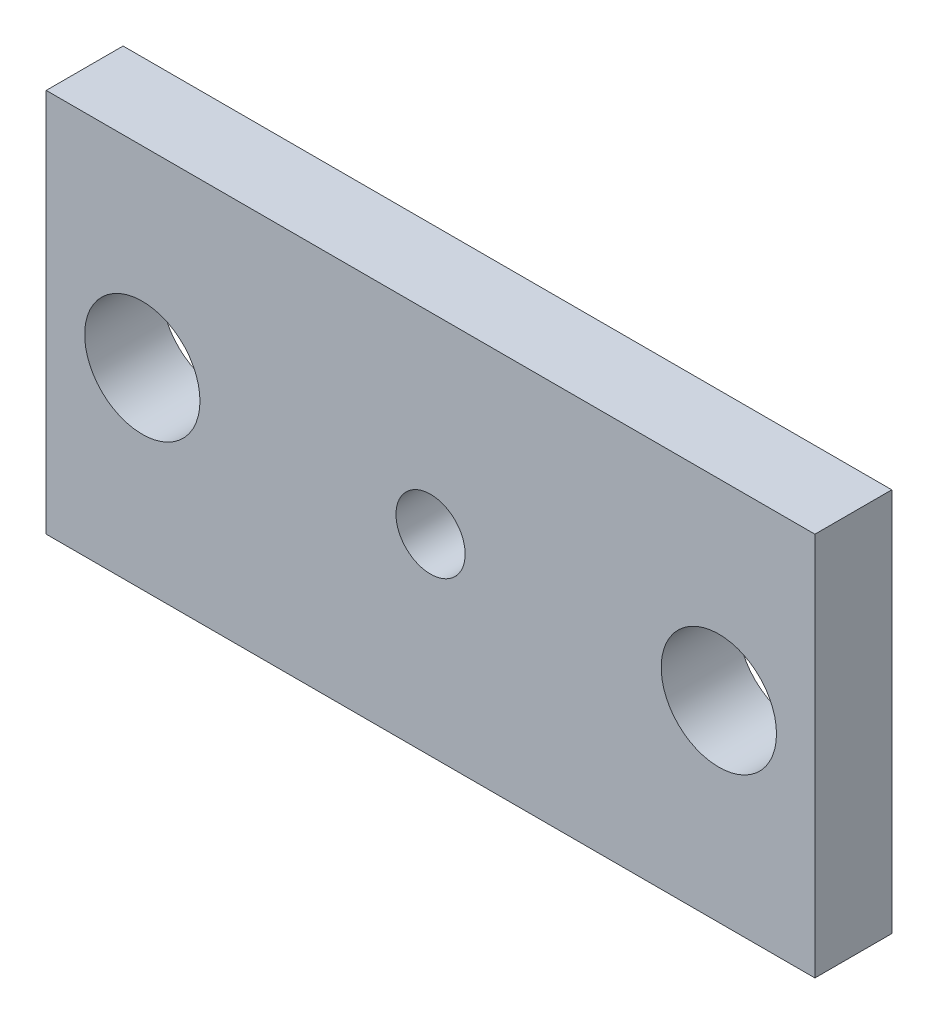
ISO-10303-21;
HEADER;
FILE_DESCRIPTION(('STEP AP214'),'2;1');
FILE_NAME('part.step','',(''),(''),'','','');
FILE_SCHEMA(('AUTOMOTIVE_DESIGN { 1 0 10303 214 1 1 1 1 }'));
ENDSEC;
DATA;
#1=APPLICATION_CONTEXT('core data for automotive mechanical design processes');
#2=APPLICATION_PROTOCOL_DEFINITION('international standard','automotive_design',2000,#1);
#3=PRODUCT_CONTEXT('',#1,'mechanical');
#4=PRODUCT('Part','Part','',(#3));
#5=PRODUCT_RELATED_PRODUCT_CATEGORY('part','',(#4));
#6=PRODUCT_DEFINITION_FORMATION('','',#4);
#7=PRODUCT_DEFINITION_CONTEXT('part definition',#1,'design');
#8=PRODUCT_DEFINITION('design','',#6,#7);
#9=PRODUCT_DEFINITION_SHAPE('','',#8);
#10=(LENGTH_UNIT() NAMED_UNIT(*) SI_UNIT(.MILLI.,.METRE.));
#11=(NAMED_UNIT(*) PLANE_ANGLE_UNIT() SI_UNIT($,.RADIAN.));
#12=(NAMED_UNIT(*) SI_UNIT($,.STERADIAN.) SOLID_ANGLE_UNIT());
#13=UNCERTAINTY_MEASURE_WITH_UNIT(LENGTH_MEASURE(1.E-05),#10,'distance_accuracy_value','');
#14=(GEOMETRIC_REPRESENTATION_CONTEXT(3) GLOBAL_UNCERTAINTY_ASSIGNED_CONTEXT((#13)) GLOBAL_UNIT_ASSIGNED_CONTEXT((#10,
#11,#12)) REPRESENTATION_CONTEXT('',''));
#15=CARTESIAN_POINT('',(0.,0.,0.));
#16=DIRECTION('',(0.,0.,1.));
#17=DIRECTION('',(1.,0.,0.));
#18=AXIS2_PLACEMENT_3D('',#15,#16,#17);
#19=CARTESIAN_POINT('',(0.,12.7,-3.81));
#20=DIRECTION('',(0.,1.,0.));
#21=DIRECTION('',(0.,0.,1.));
#22=AXIS2_PLACEMENT_3D('',#19,#20,#21);
#23=PLANE('',#22);
#24=DIRECTION('',(1.,0.,0.));
#25=VECTOR('',#24,1.);
#26=CARTESIAN_POINT('',(0.,12.7,-6.35));
#27=LINE('',#26,#25);
#28=CARTESIAN_POINT('',(0.,12.7,-6.35));
#29=VERTEX_POINT('',#28);
#30=CARTESIAN_POINT('',(25.4,12.7,-6.35));
#31=VERTEX_POINT('',#30);
#32=EDGE_CURVE('E98',#29,#31,#27,.T.);
#33=ORIENTED_EDGE('',*,*,#32,.F.);
#34=DIRECTION('',(0.,0.,-1.));
#35=VECTOR('',#34,1.);
#36=CARTESIAN_POINT('',(0.,12.7,-3.81));
#37=LINE('',#36,#35);
#38=CARTESIAN_POINT('',(0.,12.7,-3.81));
#39=VERTEX_POINT('',#38);
#40=EDGE_CURVE('E11',#39,#29,#37,.T.);
#41=ORIENTED_EDGE('',*,*,#40,.F.);
#42=DIRECTION('',(1.,0.,0.));
#43=VECTOR('',#42,1.);
#44=CARTESIAN_POINT('',(0.,12.7,-3.81));
#45=LINE('',#44,#43);
#46=CARTESIAN_POINT('',(25.4,12.7,-3.81));
#47=VERTEX_POINT('',#46);
#48=EDGE_CURVE('E91',#39,#47,#45,.T.);
#49=ORIENTED_EDGE('',*,*,#48,.T.);
#50=DIRECTION('',(0.,0.,-1.));
#51=VECTOR('',#50,1.);
#52=CARTESIAN_POINT('',(25.4,12.7,-3.81));
#53=LINE('',#52,#51);
#54=EDGE_CURVE('E36',#47,#31,#53,.T.);
#55=ORIENTED_EDGE('',*,*,#54,.T.);
#56=EDGE_LOOP('',(#33,#41,#49,#55));
#57=FACE_BOUND('',#56,.T.);
#58=ADVANCED_FACE('F33',(#57),#23,.T.);
#59=CARTESIAN_POINT('',(0.,0.,-3.81));
#60=DIRECTION('',(-1.,0.,0.));
#61=DIRECTION('',(0.,0.,1.));
#62=AXIS2_PLACEMENT_3D('',#59,#60,#61);
#63=PLANE('',#62);
#64=DIRECTION('',(0.,1.,0.));
#65=VECTOR('',#64,1.);
#66=CARTESIAN_POINT('',(0.,0.,-6.35));
#67=LINE('',#66,#65);
#68=CARTESIAN_POINT('',(0.,0.,-6.35));
#69=VERTEX_POINT('',#68);
#70=EDGE_CURVE('E93',#69,#29,#67,.T.);
#71=ORIENTED_EDGE('',*,*,#70,.F.);
#72=DIRECTION('',(0.,0.,-1.));
#73=VECTOR('',#72,1.);
#74=CARTESIAN_POINT('',(0.,0.,-3.81));
#75=LINE('',#74,#73);
#76=CARTESIAN_POINT('',(0.,0.,-3.81));
#77=VERTEX_POINT('',#76);
#78=EDGE_CURVE('E42',#77,#69,#75,.T.);
#79=ORIENTED_EDGE('',*,*,#78,.F.);
#80=DIRECTION('',(0.,1.,0.));
#81=VECTOR('',#80,1.);
#82=CARTESIAN_POINT('',(0.,0.,-3.81));
#83=LINE('',#82,#81);
#84=EDGE_CURVE('E88',#77,#39,#83,.T.);
#85=ORIENTED_EDGE('',*,*,#84,.T.);
#86=ORIENTED_EDGE('',*,*,#40,.T.);
#87=EDGE_LOOP('',(#71,#79,#85,#86));
#88=FACE_BOUND('',#87,.T.);
#89=ADVANCED_FACE('F109',(#88),#63,.T.);
#90=CARTESIAN_POINT('',(25.4,0.,-3.81));
#91=DIRECTION('',(0.,-1.,0.));
#92=DIRECTION('',(0.,0.,-1.));
#93=AXIS2_PLACEMENT_3D('',#90,#91,#92);
#94=PLANE('',#93);
#95=DIRECTION('',(-1.,0.,0.));
#96=VECTOR('',#95,1.);
#97=CARTESIAN_POINT('',(25.4,0.,-6.35));
#98=LINE('',#97,#96);
#99=CARTESIAN_POINT('',(25.4,0.,-6.35));
#100=VERTEX_POINT('',#99);
#101=EDGE_CURVE('E83',#100,#69,#98,.T.);
#102=ORIENTED_EDGE('',*,*,#101,.F.);
#103=DIRECTION('',(0.,0.,-1.));
#104=VECTOR('',#103,1.);
#105=CARTESIAN_POINT('',(25.4,0.,-3.81));
#106=LINE('',#105,#104);
#107=CARTESIAN_POINT('',(25.4,0.,-3.81));
#108=VERTEX_POINT('',#107);
#109=EDGE_CURVE('E78',#108,#100,#106,.T.);
#110=ORIENTED_EDGE('',*,*,#109,.F.);
#111=DIRECTION('',(-1.,0.,0.));
#112=VECTOR('',#111,1.);
#113=CARTESIAN_POINT('',(25.4,0.,-3.81));
#114=LINE('',#113,#112);
#115=EDGE_CURVE('E81',#108,#77,#114,.T.);
#116=ORIENTED_EDGE('',*,*,#115,.T.);
#117=ORIENTED_EDGE('',*,*,#78,.T.);
#118=EDGE_LOOP('',(#102,#110,#116,#117));
#119=FACE_BOUND('',#118,.T.);
#120=ADVANCED_FACE('F80',(#119),#94,.T.);
#121=CARTESIAN_POINT('',(25.4,12.7,-3.81));
#122=DIRECTION('',(1.,0.,0.));
#123=DIRECTION('',(0.,0.,-1.));
#124=AXIS2_PLACEMENT_3D('',#121,#122,#123);
#125=PLANE('',#124);
#126=DIRECTION('',(0.,-1.,0.));
#127=VECTOR('',#126,1.);
#128=CARTESIAN_POINT('',(25.4,12.7,-6.35));
#129=LINE('',#128,#127);
#130=EDGE_CURVE('E101',#31,#100,#129,.T.);
#131=ORIENTED_EDGE('',*,*,#130,.F.);
#132=ORIENTED_EDGE('',*,*,#54,.F.);
#133=DIRECTION('',(0.,-1.,0.));
#134=VECTOR('',#133,1.);
#135=CARTESIAN_POINT('',(25.4,12.7,-3.81));
#136=LINE('',#135,#134);
#137=EDGE_CURVE('E87',#47,#108,#136,.T.);
#138=ORIENTED_EDGE('',*,*,#137,.T.);
#139=ORIENTED_EDGE('',*,*,#109,.T.);
#140=EDGE_LOOP('',(#131,#132,#138,#139));
#141=FACE_BOUND('',#140,.T.);
#142=ADVANCED_FACE('F90',(#141),#125,.T.);
#143=CARTESIAN_POINT('',(25.4,12.7,-3.81));
#144=DIRECTION('',(0.,0.,-1.));
#145=DIRECTION('',(-1.,0.,0.));
#146=AXIS2_PLACEMENT_3D('',#143,#144,#145);
#147=PLANE('',#146);
#148=CARTESIAN_POINT('',(12.7,6.35,-3.81));
#149=DIRECTION('',(0.,0.,-1.));
#150=DIRECTION('',(1.,0.,0.));
#151=AXIS2_PLACEMENT_3D('',#148,#149,#150);
#152=CIRCLE('',#151,1.143);
#153=CARTESIAN_POINT('',(13.843,6.35,-3.81));
#154=VERTEX_POINT('',#153);
#155=EDGE_CURVE('E146',#154,#154,#152,.T.);
#156=ORIENTED_EDGE('',*,*,#155,.T.);
#157=EDGE_LOOP('',(#156));
#158=FACE_BOUND('',#157,.T.);
#159=CARTESIAN_POINT('',(3.175,6.35,-3.81));
#160=DIRECTION('',(0.,0.,-1.));
#161=DIRECTION('',(1.,0.,0.));
#162=AXIS2_PLACEMENT_3D('',#159,#160,#161);
#163=CIRCLE('',#162,1.905);
#164=CARTESIAN_POINT('',(5.08,6.35,-3.81));
#165=VERTEX_POINT('',#164);
#166=EDGE_CURVE('E154',#165,#165,#163,.T.);
#167=ORIENTED_EDGE('',*,*,#166,.T.);
#168=EDGE_LOOP('',(#167));
#169=FACE_BOUND('',#168,.T.);
#170=CARTESIAN_POINT('',(22.225,6.35,-3.81));
#171=DIRECTION('',(0.,0.,-1.));
#172=DIRECTION('',(1.,0.,0.));
#173=AXIS2_PLACEMENT_3D('',#170,#171,#172);
#174=CIRCLE('',#173,1.905);
#175=CARTESIAN_POINT('',(24.13,6.35,-3.81));
#176=VERTEX_POINT('',#175);
#177=EDGE_CURVE('E102',#176,#176,#174,.T.);
#178=ORIENTED_EDGE('',*,*,#177,.T.);
#179=EDGE_LOOP('',(#178));
#180=FACE_BOUND('',#179,.T.);
#181=ORIENTED_EDGE('',*,*,#48,.F.);
#182=ORIENTED_EDGE('',*,*,#84,.F.);
#183=ORIENTED_EDGE('',*,*,#115,.F.);
#184=ORIENTED_EDGE('',*,*,#137,.F.);
#185=EDGE_LOOP('',(#181,#182,#183,#184));
#186=FACE_BOUND('',#185,.T.);
#187=ADVANCED_FACE('F86',(#158,#169,#180,#186),#147,.F.);
#188=CARTESIAN_POINT('',(25.4,12.7,-6.35));
#189=DIRECTION('',(0.,0.,-1.));
#190=DIRECTION('',(-1.,0.,0.));
#191=AXIS2_PLACEMENT_3D('',#188,#189,#190);
#192=PLANE('',#191);
#193=CARTESIAN_POINT('',(12.7,6.35,-6.35));
#194=DIRECTION('',(0.,0.,-1.));
#195=DIRECTION('',(1.,0.,0.));
#196=AXIS2_PLACEMENT_3D('',#193,#194,#195);
#197=CIRCLE('',#196,1.143);
#198=CARTESIAN_POINT('',(13.843,6.35,-6.35));
#199=VERTEX_POINT('',#198);
#200=EDGE_CURVE('E149',#199,#199,#197,.T.);
#201=ORIENTED_EDGE('',*,*,#200,.F.);
#202=EDGE_LOOP('',(#201));
#203=FACE_BOUND('',#202,.T.);
#204=CARTESIAN_POINT('',(3.175,6.35,-6.35));
#205=DIRECTION('',(0.,0.,-1.));
#206=DIRECTION('',(1.,0.,0.));
#207=AXIS2_PLACEMENT_3D('',#204,#205,#206);
#208=CIRCLE('',#207,1.905);
#209=CARTESIAN_POINT('',(5.08,6.35,-6.35));
#210=VERTEX_POINT('',#209);
#211=EDGE_CURVE('E151',#210,#210,#208,.T.);
#212=ORIENTED_EDGE('',*,*,#211,.F.);
#213=EDGE_LOOP('',(#212));
#214=FACE_BOUND('',#213,.T.);
#215=CARTESIAN_POINT('',(22.225,6.35,-6.35));
#216=DIRECTION('',(0.,0.,-1.));
#217=DIRECTION('',(1.,0.,0.));
#218=AXIS2_PLACEMENT_3D('',#215,#216,#217);
#219=CIRCLE('',#218,1.905);
#220=CARTESIAN_POINT('',(24.13,6.35,-6.35));
#221=VERTEX_POINT('',#220);
#222=EDGE_CURVE('E157',#221,#221,#219,.T.);
#223=ORIENTED_EDGE('',*,*,#222,.F.);
#224=EDGE_LOOP('',(#223));
#225=FACE_BOUND('',#224,.T.);
#226=ORIENTED_EDGE('',*,*,#32,.T.);
#227=ORIENTED_EDGE('',*,*,#130,.T.);
#228=ORIENTED_EDGE('',*,*,#101,.T.);
#229=ORIENTED_EDGE('',*,*,#70,.T.);
#230=EDGE_LOOP('',(#226,#227,#228,#229));
#231=FACE_BOUND('',#230,.T.);
#232=ADVANCED_FACE('F108',(#203,#214,#225,#231),#192,.T.);
#233=CARTESIAN_POINT('',(22.225,6.35,-3.81));
#234=DIRECTION('',(0.,0.,-1.));
#235=DIRECTION('',(-1.,0.,0.));
#236=AXIS2_PLACEMENT_3D('',#233,#234,#235);
#237=CYLINDRICAL_SURFACE('',#236,1.905);
#238=ORIENTED_EDGE('',*,*,#177,.F.);
#239=EDGE_LOOP('',(#238));
#240=FACE_BOUND('',#239,.T.);
#241=ORIENTED_EDGE('',*,*,#222,.T.);
#242=EDGE_LOOP('',(#241));
#243=FACE_BOUND('',#242,.T.);
#244=ADVANCED_FACE('F127',(#240,#243),#237,.F.);
#245=CARTESIAN_POINT('',(3.175,6.35,-3.81));
#246=DIRECTION('',(0.,0.,-1.));
#247=DIRECTION('',(-1.,0.,0.));
#248=AXIS2_PLACEMENT_3D('',#245,#246,#247);
#249=CYLINDRICAL_SURFACE('',#248,1.905);
#250=ORIENTED_EDGE('',*,*,#166,.F.);
#251=EDGE_LOOP('',(#250));
#252=FACE_BOUND('',#251,.T.);
#253=ORIENTED_EDGE('',*,*,#211,.T.);
#254=EDGE_LOOP('',(#253));
#255=FACE_BOUND('',#254,.T.);
#256=ADVANCED_FACE('F134',(#252,#255),#249,.F.);
#257=CARTESIAN_POINT('',(12.7,6.35,-3.81));
#258=DIRECTION('',(0.,0.,-1.));
#259=DIRECTION('',(-1.,0.,0.));
#260=AXIS2_PLACEMENT_3D('',#257,#258,#259);
#261=CYLINDRICAL_SURFACE('',#260,1.143);
#262=ORIENTED_EDGE('',*,*,#155,.F.);
#263=EDGE_LOOP('',(#262));
#264=FACE_BOUND('',#263,.T.);
#265=ORIENTED_EDGE('',*,*,#200,.T.);
#266=EDGE_LOOP('',(#265));
#267=FACE_BOUND('',#266,.T.);
#268=ADVANCED_FACE('F138',(#264,#267),#261,.F.);
#269=CLOSED_SHELL('',(#58,#89,#120,#142,#187,#232,#244,#256,#268));
#270=MANIFOLD_SOLID_BREP('B2',#269);
#271=ADVANCED_BREP_SHAPE_REPRESENTATION('',(#18,#270),#14);
#272=SHAPE_DEFINITION_REPRESENTATION(#9,#271);
ENDSEC;
END-ISO-10303-21;
